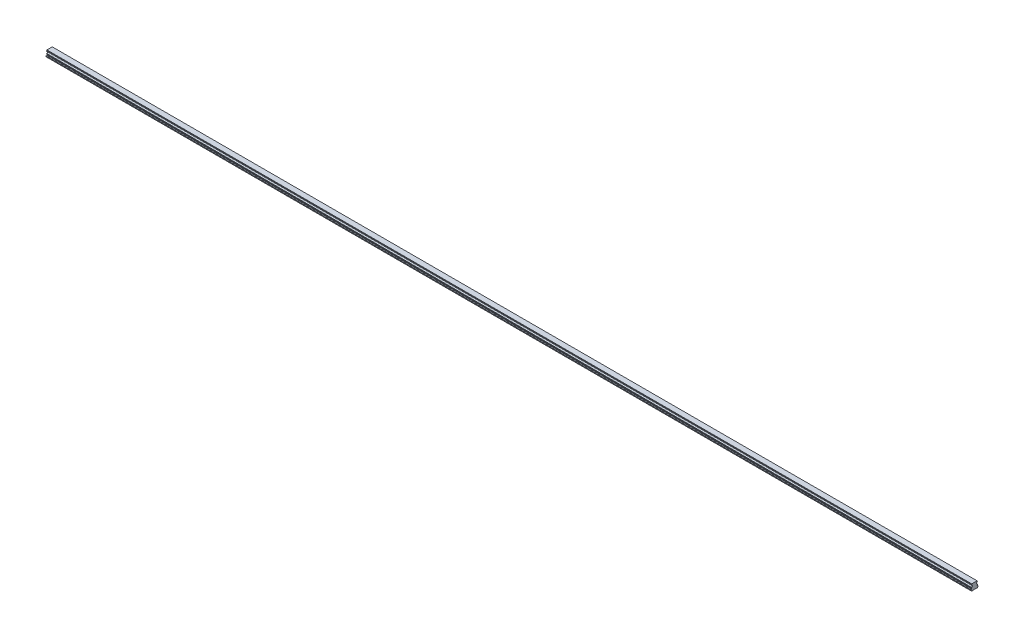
from build123d import *

# Parameters (mm, degrees)
BOSS_EXTRUDE1_DEPTH        = 3240
SKETCH3_R                  = 3
SKETCH3_R_2                = 2.5
CUT_EXTRUDE3_DEPTH         = 12
SKETCH3_2_R                = 2.5
CUT_EXTRUDE4_DEPTH         = 15
CHAMFER1_SIZE              = 0.5
LPATTERN4_COUNT            = 54
LPATTERN4_PITCH            = 60
CHAMFER1_OF_LPATTERN4_SIZE = 0.5


with BuildPart() as part:
    # Sketch1 → Boss-Extrude1 (new body)
    with BuildSketch(Plane(origin=(0, 0, 0), x_dir=(0, 0, -1), z_dir=(1, 0, 0))):
        with BuildLine():
            Line((9.375, 21.8), (-9.375, 21.8))
            Line((-9.375, 21.8), (-9.375, 20.756))
            Line((-9.375, 20.756), (-10, 19.415683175))
            Line((-10, 19.415683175), (-10, 17.685449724))
            ThreePointArc((-10, 17.685449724), (-7.2, 14.6), (-10, 11.514550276))
            Line((-10, 11.514550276), (-10, 9.784316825))
            Line((-10, 9.784316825), (-9.375, 8.444))
            Line((-9.375, 8.444), (-9.922688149, 6.4))
            Line((-9.922688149, 6.4), (-12.5, 5.489338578))
            Line((-12.5, 5.489338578), (-12.5, 2.65))
            Line((-12.5, 2.65), (-9.85, 0))
            Line((-9.85, 0), (-5.5, 0))
            Line((-5.5, 0), (-5, 0.5))
            Line((-5, 0.5), (5, 0.5))
            Line((5, 0.5), (5.5, 0))
            Line((5.5, 0), (9.85, 0))
            Line((9.85, 0), (12.5, 2.65))
            Line((12.5, 2.65), (12.5, 5.489338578))
            Line((12.5, 5.489338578), (9.922688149, 6.4))
            Line((9.922688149, 6.4), (9.375, 8.444))
            Line((9.375, 8.444), (10, 9.784316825))
            Line((10, 9.784316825), (10, 11.514550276))
            ThreePointArc((10, 11.514550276), (7.2, 14.6), (10, 17.685449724))
            Line((10, 17.685449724), (10, 19.415683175))
            Line((10, 19.415683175), (9.375, 20.756))
            Line((9.375, 20.756), (9.375, 21.8))
        make_face()
    extrude(amount=BOSS_EXTRUDE1_DEPTH)

    # Sketch3 → Cut-Extrude3 (cut)
    with BuildSketch(Plane.XZ):
        with Locations(Location((30, 0, 0), (0, 0, 270))):
            Circle(SKETCH3_R)
        with Locations(Location((30, 0, 0), (0, 0, 270))):
            Circle(SKETCH3_R_2, mode=Mode.SUBTRACT)
    cut_extrude3 = extrude(amount=-CUT_EXTRUDE3_DEPTH, mode=Mode.SUBTRACT)

    # Sketch3_2 → Cut-Extrude4 (cut)
    with BuildSketch(Plane.XZ):
        with Locations(Location((30, 0, 0), (0, 0, 270))):
            Circle(SKETCH3_2_R)
    cut_extrude4 = extrude(amount=-CUT_EXTRUDE4_DEPTH, mode=Mode.SUBTRACT)

    # Cut-Extrude5 cone 1 section (on through the dimple's axis) → Cut-Extrude5 (revolve, cut)
    with BuildSketch(Plane(origin=(30, 15, 0), x_dir=(0, 0, -1), z_dir=(1, 0, 0))):
        Polygon((0, 0), (2.5, 0), (0, 1.443375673), align=None)
    cut_extrude5 = revolve(axis=Axis((30, 15, 0), (0, 1, 0)), mode=Mode.SUBTRACT)

    # Chamfer1
    chamfer1_edges = [part.edges().sort_by_distance(p)[0] for p in [
        (30, 0.5, 3),
    ]]
    chamfer(chamfer1_edges, length=CHAMFER1_SIZE)

    # LPattern4: Cut-Extrude3, Cut-Extrude4, Cut-Extrude5 ×54
    with Locations(*[(i * LPATTERN4_PITCH, 0, 0) for i in range(1, LPATTERN4_COUNT)]):
        add(cut_extrude3, mode=Mode.SUBTRACT)
        add(cut_extrude4, mode=Mode.SUBTRACT)
        add(cut_extrude5, mode=Mode.SUBTRACT)

    # Chamfer1 of LPattern4
    chamfer1_of_lpattern4_edges = [part.edges().sort_by_distance(p)[0] for p in [
        (90, 0.5, 3),
        (150, 0.5, 3),
        (210, 0.5, 3),
        (270, 0.5, 3),
        (330, 0.5, 3),
        (390, 0.5, 3),
        (450, 0.5, 3),
        (510, 0.5, 3),
        (570, 0.5, 3),
        (630, 0.5, 3),
        (690, 0.5, 3),
        (750, 0.5, 3),
        (810, 0.5, 3),
        (870, 0.5, 3),
        (930, 0.5, 3),
        (990, 0.5, 3),
        (1050, 0.5, 3),
        (1110, 0.5, 3),
        (1170, 0.5, 3),
        (1230, 0.5, 3),
        (1290, 0.5, 3),
        (1350, 0.5, 3),
        (1410, 0.5, 3),
        (1470, 0.5, 3),
        (1530, 0.5, 3),
        (1590, 0.5, 3),
        (1650, 0.5, 3),
        (1710, 0.5, 3),
        (1770, 0.5, 3),
        (1830, 0.5, 3),
        (1890, 0.5, 3),
        (1950, 0.5, 3),
        (2010, 0.5, 3),
        (2070, 0.5, 3),
        (2130, 0.5, 3),
        (2190, 0.5, 3),
        (2250, 0.5, 3),
        (2310, 0.5, 3),
        (2370, 0.5, 3),
        (2430, 0.5, 3),
        (2490, 0.5, 3),
        (2550, 0.5, 3),
        (2610, 0.5, 3),
        (2670, 0.5, 3),
        (2730, 0.5, 3),
        (2790, 0.5, 3),
        (2850, 0.5, 3),
        (2910, 0.5, 3),
        (2970, 0.5, 3),
        (3030, 0.5, 3),
        (3090, 0.5, 3),
        (3150, 0.5, 3),
        (3210, 0.5, 3),
    ]]
    chamfer(chamfer1_of_lpattern4_edges, length=CHAMFER1_OF_LPATTERN4_SIZE)


solid = part.part
